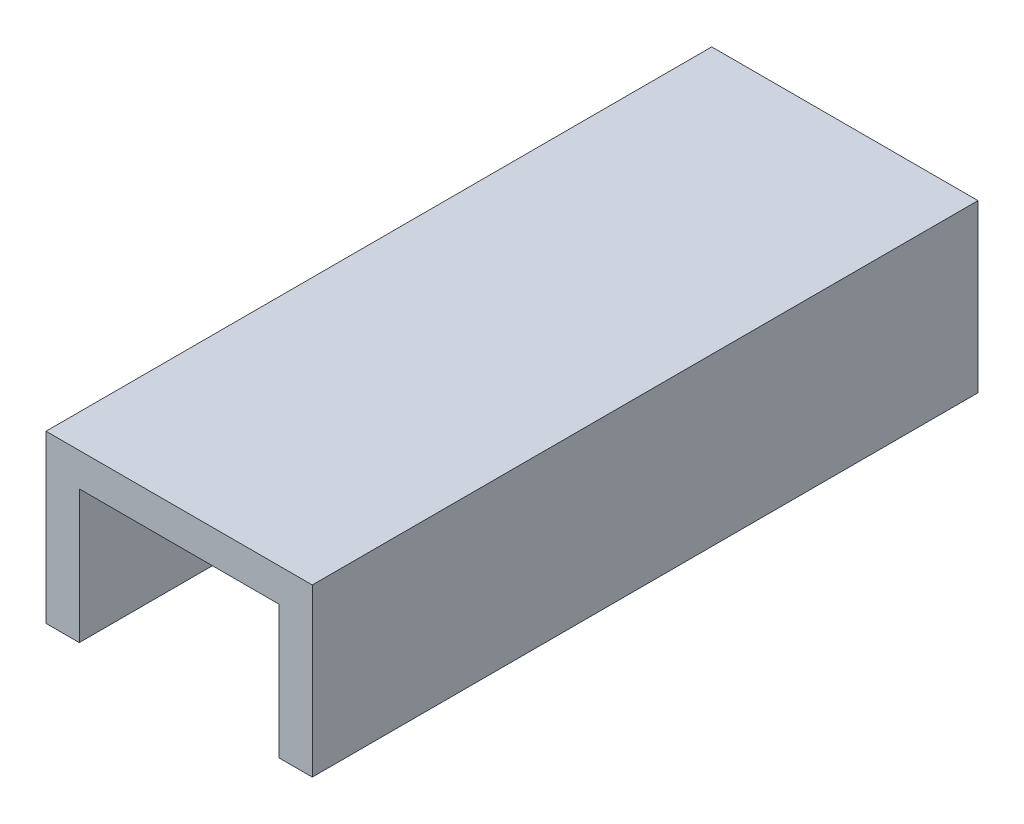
from build123d import *

# Parameters (mm, degrees)
LINEAR_AUSTRAGEN1_DEPTH = 200


with BuildPart() as part:
    # Skizze1 → Linear austragen1 (new body)
    with BuildSketch(Plane.XY):
        Polygon((-40, 10), (40, 10), (40, -40), (30, -40), (30, 0), (-30, 0), (-30, -40), (-40, -40), align=None)
    extrude(amount=LINEAR_AUSTRAGEN1_DEPTH)


solid = part.part
